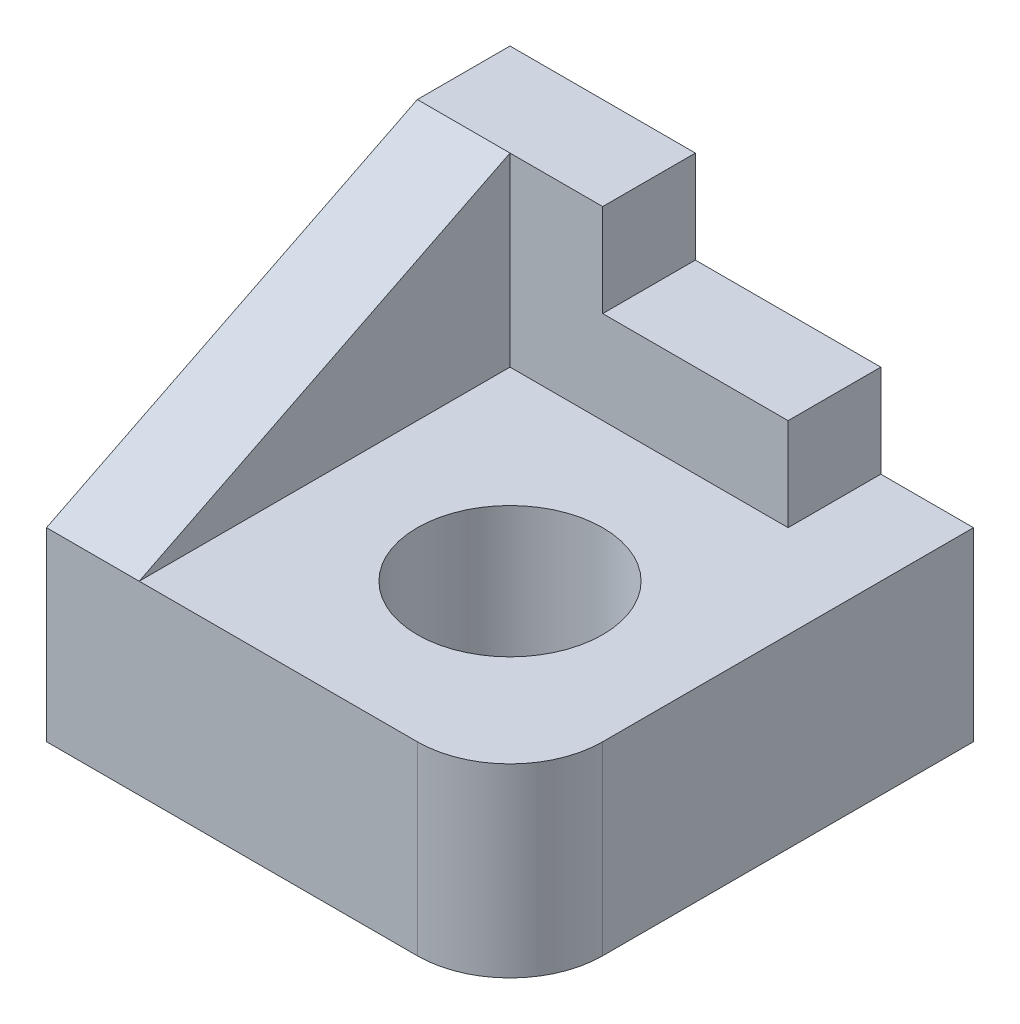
ISO-10303-21;
HEADER;
FILE_DESCRIPTION(('STEP AP214'),'2;1');
FILE_NAME('part.step','',(''),(''),'','','');
FILE_SCHEMA(('AUTOMOTIVE_DESIGN { 1 0 10303 214 1 1 1 1 }'));
ENDSEC;
DATA;
#1=APPLICATION_CONTEXT('core data for automotive mechanical design processes');
#2=APPLICATION_PROTOCOL_DEFINITION('international standard','automotive_design',2000,#1);
#3=PRODUCT_CONTEXT('',#1,'mechanical');
#4=PRODUCT('Part','Part','',(#3));
#5=PRODUCT_RELATED_PRODUCT_CATEGORY('part','',(#4));
#6=PRODUCT_DEFINITION_FORMATION('','',#4);
#7=PRODUCT_DEFINITION_CONTEXT('part definition',#1,'design');
#8=PRODUCT_DEFINITION('design','',#6,#7);
#9=PRODUCT_DEFINITION_SHAPE('','',#8);
#10=(LENGTH_UNIT() NAMED_UNIT(*) SI_UNIT(.MILLI.,.METRE.));
#11=(NAMED_UNIT(*) PLANE_ANGLE_UNIT() SI_UNIT($,.RADIAN.));
#12=(NAMED_UNIT(*) SI_UNIT($,.STERADIAN.) SOLID_ANGLE_UNIT());
#13=UNCERTAINTY_MEASURE_WITH_UNIT(LENGTH_MEASURE(1.E-05),#10,'distance_accuracy_value','');
#14=(GEOMETRIC_REPRESENTATION_CONTEXT(3) GLOBAL_UNCERTAINTY_ASSIGNED_CONTEXT((#13)) GLOBAL_UNIT_ASSIGNED_CONTEXT((#10,
#11,#12)) REPRESENTATION_CONTEXT('',''));
#15=CARTESIAN_POINT('',(0.,0.,0.));
#16=DIRECTION('',(0.,0.,1.));
#17=DIRECTION('',(1.,0.,0.));
#18=AXIS2_PLACEMENT_3D('',#15,#16,#17);
#19=CARTESIAN_POINT('',(0.,20.,0.));
#20=DIRECTION('',(1.,0.,0.));
#21=DIRECTION('',(0.,0.,-1.));
#22=AXIS2_PLACEMENT_3D('',#19,#20,#21);
#23=PLANE('',#22);
#24=DIRECTION('',(0.,-1.,0.));
#25=VECTOR('',#24,1.);
#26=CARTESIAN_POINT('',(0.,20.,50.));
#27=LINE('',#26,#25);
#28=CARTESIAN_POINT('',(0.,20.,50.));
#29=VERTEX_POINT('',#28);
#30=CARTESIAN_POINT('',(0.,0.,50.));
#31=VERTEX_POINT('',#30);
#32=EDGE_CURVE('E128',#29,#31,#27,.T.);
#33=ORIENTED_EDGE('',*,*,#32,.F.);
#34=DIRECTION('',(0.,-0.447213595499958,0.894427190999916));
#35=VECTOR('',#34,1.);
#36=CARTESIAN_POINT('',(0.,40.,10.));
#37=LINE('',#36,#35);
#38=CARTESIAN_POINT('',(0.,40.,10.));
#39=VERTEX_POINT('',#38);
#40=EDGE_CURVE('E113',#39,#29,#37,.T.);
#41=ORIENTED_EDGE('',*,*,#40,.F.);
#42=DIRECTION('',(0.,0.,-1.));
#43=VECTOR('',#42,1.);
#44=CARTESIAN_POINT('',(0.,40.,10.));
#45=LINE('',#44,#43);
#46=CARTESIAN_POINT('',(0.,40.,0.));
#47=VERTEX_POINT('',#46);
#48=EDGE_CURVE('E166',#39,#47,#45,.T.);
#49=ORIENTED_EDGE('',*,*,#48,.T.);
#50=DIRECTION('',(0.,-1.,0.));
#51=VECTOR('',#50,1.);
#52=CARTESIAN_POINT('',(0.,20.,0.));
#53=LINE('',#52,#51);
#54=CARTESIAN_POINT('',(0.,0.,0.));
#55=VERTEX_POINT('',#54);
#56=EDGE_CURVE('E142',#47,#55,#53,.T.);
#57=ORIENTED_EDGE('',*,*,#56,.T.);
#58=DIRECTION('',(0.,0.,1.));
#59=VECTOR('',#58,1.);
#60=CARTESIAN_POINT('',(0.,0.,0.));
#61=LINE('',#60,#59);
#62=EDGE_CURVE('E134',#55,#31,#61,.T.);
#63=ORIENTED_EDGE('',*,*,#62,.T.);
#64=EDGE_LOOP('',(#33,#41,#49,#57,#63));
#65=FACE_BOUND('',#64,.T.);
#66=ADVANCED_FACE('F30',(#65),#23,.F.);
#67=CARTESIAN_POINT('',(0.,20.,50.));
#68=DIRECTION('',(0.,0.,-1.));
#69=DIRECTION('',(-1.,0.,0.));
#70=AXIS2_PLACEMENT_3D('',#67,#68,#69);
#71=PLANE('',#70);
#72=DIRECTION('',(1.,0.,0.));
#73=VECTOR('',#72,1.);
#74=CARTESIAN_POINT('',(0.,20.,50.));
#75=LINE('',#74,#73);
#76=CARTESIAN_POINT('',(10.,20.,50.));
#77=VERTEX_POINT('',#76);
#78=CARTESIAN_POINT('',(40.,20.,50.));
#79=VERTEX_POINT('',#78);
#80=EDGE_CURVE('E45',#77,#79,#75,.T.);
#81=ORIENTED_EDGE('',*,*,#80,.F.);
#82=EDGE_CURVE('E117',#29,#77,#75,.T.);
#83=ORIENTED_EDGE('',*,*,#82,.F.);
#84=ORIENTED_EDGE('',*,*,#32,.T.);
#85=DIRECTION('',(1.,0.,0.));
#86=VECTOR('',#85,1.);
#87=CARTESIAN_POINT('',(0.,0.,50.));
#88=LINE('',#87,#86);
#89=CARTESIAN_POINT('',(40.,0.,50.));
#90=VERTEX_POINT('',#89);
#91=EDGE_CURVE('E52',#31,#90,#88,.T.);
#92=ORIENTED_EDGE('',*,*,#91,.T.);
#93=DIRECTION('',(0.,-1.,0.));
#94=VECTOR('',#93,1.);
#95=CARTESIAN_POINT('',(40.,20.,50.));
#96=LINE('',#95,#94);
#97=EDGE_CURVE('E147',#90,#79,#96,.F.);
#98=ORIENTED_EDGE('',*,*,#97,.T.);
#99=EDGE_LOOP('',(#81,#83,#84,#92,#98));
#100=FACE_BOUND('',#99,.T.);
#101=ADVANCED_FACE('F127',(#100),#71,.F.);
#102=CARTESIAN_POINT('',(50.,20.,0.));
#103=DIRECTION('',(-1.,0.,0.));
#104=DIRECTION('',(0.,0.,1.));
#105=AXIS2_PLACEMENT_3D('',#102,#103,#104);
#106=PLANE('',#105);
#107=DIRECTION('',(0.,0.,-1.));
#108=VECTOR('',#107,1.);
#109=CARTESIAN_POINT('',(50.,20.,0.));
#110=LINE('',#109,#108);
#111=CARTESIAN_POINT('',(50.,20.,40.));
#112=VERTEX_POINT('',#111);
#113=CARTESIAN_POINT('',(50.,20.,0.));
#114=VERTEX_POINT('',#113);
#115=EDGE_CURVE('E130',#112,#114,#110,.T.);
#116=ORIENTED_EDGE('',*,*,#115,.F.);
#117=DIRECTION('',(0.,-1.,0.));
#118=VECTOR('',#117,1.);
#119=CARTESIAN_POINT('',(50.,20.,40.));
#120=LINE('',#119,#118);
#121=CARTESIAN_POINT('',(50.,0.,40.));
#122=VERTEX_POINT('',#121);
#123=EDGE_CURVE('E135',#112,#122,#120,.T.);
#124=ORIENTED_EDGE('',*,*,#123,.T.);
#125=DIRECTION('',(0.,0.,-1.));
#126=VECTOR('',#125,1.);
#127=CARTESIAN_POINT('',(50.,0.,0.));
#128=LINE('',#127,#126);
#129=CARTESIAN_POINT('',(50.,0.,0.));
#130=VERTEX_POINT('',#129);
#131=EDGE_CURVE('E163',#122,#130,#128,.T.);
#132=ORIENTED_EDGE('',*,*,#131,.T.);
#133=DIRECTION('',(0.,-1.,0.));
#134=VECTOR('',#133,1.);
#135=CARTESIAN_POINT('',(50.,20.,0.));
#136=LINE('',#135,#134);
#137=EDGE_CURVE('E136',#114,#130,#136,.T.);
#138=ORIENTED_EDGE('',*,*,#137,.F.);
#139=EDGE_LOOP('',(#116,#124,#132,#138));
#140=FACE_BOUND('',#139,.T.);
#141=ADVANCED_FACE('F182',(#140),#106,.F.);
#142=CARTESIAN_POINT('',(0.,20.,0.));
#143=DIRECTION('',(0.,0.,1.));
#144=DIRECTION('',(1.,0.,0.));
#145=AXIS2_PLACEMENT_3D('',#142,#143,#144);
#146=PLANE('',#145);
#147=DIRECTION('',(-1.,0.,0.));
#148=VECTOR('',#147,1.);
#149=CARTESIAN_POINT('',(0.,0.,0.));
#150=LINE('',#149,#148);
#151=EDGE_CURVE('E165',#130,#55,#150,.T.);
#152=ORIENTED_EDGE('',*,*,#151,.T.);
#153=ORIENTED_EDGE('',*,*,#56,.F.);
#154=DIRECTION('',(1.,0.,0.));
#155=VECTOR('',#154,1.);
#156=CARTESIAN_POINT('',(0.,40.,0.));
#157=LINE('',#156,#155);
#158=CARTESIAN_POINT('',(20.,40.,0.));
#159=VERTEX_POINT('',#158);
#160=EDGE_CURVE('E210',#47,#159,#157,.T.);
#161=ORIENTED_EDGE('',*,*,#160,.T.);
#162=DIRECTION('',(0.,-1.,0.));
#163=VECTOR('',#162,1.);
#164=CARTESIAN_POINT('',(20.,40.,0.));
#165=LINE('',#164,#163);
#166=CARTESIAN_POINT('',(20.,30.,0.));
#167=VERTEX_POINT('',#166);
#168=EDGE_CURVE('E206',#159,#167,#165,.T.);
#169=ORIENTED_EDGE('',*,*,#168,.T.);
#170=DIRECTION('',(1.,0.,0.));
#171=VECTOR('',#170,1.);
#172=CARTESIAN_POINT('',(20.,30.,0.));
#173=LINE('',#172,#171);
#174=CARTESIAN_POINT('',(40.,30.,0.));
#175=VERTEX_POINT('',#174);
#176=EDGE_CURVE('E203',#167,#175,#173,.T.);
#177=ORIENTED_EDGE('',*,*,#176,.T.);
#178=DIRECTION('',(0.,-1.,0.));
#179=VECTOR('',#178,1.);
#180=CARTESIAN_POINT('',(40.,30.,0.));
#181=LINE('',#180,#179);
#182=CARTESIAN_POINT('',(40.,20.,0.));
#183=VERTEX_POINT('',#182);
#184=EDGE_CURVE('E188',#175,#183,#181,.T.);
#185=ORIENTED_EDGE('',*,*,#184,.T.);
#186=DIRECTION('',(-1.,0.,0.));
#187=VECTOR('',#186,1.);
#188=CARTESIAN_POINT('',(0.,20.,0.));
#189=LINE('',#188,#187);
#190=EDGE_CURVE('E150',#114,#183,#189,.T.);
#191=ORIENTED_EDGE('',*,*,#190,.F.);
#192=ORIENTED_EDGE('',*,*,#137,.T.);
#193=EDGE_LOOP('',(#152,#153,#161,#169,#177,#185,#191,#192));
#194=FACE_BOUND('',#193,.T.);
#195=ADVANCED_FACE('F185',(#194),#146,.F.);
#196=CARTESIAN_POINT('',(0.,20.,50.));
#197=DIRECTION('',(0.,1.,0.));
#198=DIRECTION('',(0.,0.,1.));
#199=AXIS2_PLACEMENT_3D('',#196,#197,#198);
#200=PLANE('',#199);
#201=DIRECTION('',(0.,0.,-1.));
#202=VECTOR('',#201,1.);
#203=CARTESIAN_POINT('',(10.,20.,50.));
#204=LINE('',#203,#202);
#205=CARTESIAN_POINT('',(10.,20.,10.));
#206=VERTEX_POINT('',#205);
#207=EDGE_CURVE('E331',#77,#206,#204,.T.);
#208=ORIENTED_EDGE('',*,*,#207,.F.);
#209=ORIENTED_EDGE('',*,*,#80,.T.);
#210=CARTESIAN_POINT('',(40.,20.,40.));
#211=DIRECTION('',(0.,1.,0.));
#212=DIRECTION('',(0.,0.,1.));
#213=AXIS2_PLACEMENT_3D('',#210,#211,#212);
#214=CIRCLE('',#213,10.);
#215=EDGE_CURVE('E38',#79,#112,#214,.T.);
#216=ORIENTED_EDGE('',*,*,#215,.T.);
#217=ORIENTED_EDGE('',*,*,#115,.T.);
#218=ORIENTED_EDGE('',*,*,#190,.T.);
#219=DIRECTION('',(0.,0.,-1.));
#220=VECTOR('',#219,1.);
#221=CARTESIAN_POINT('',(40.,20.,10.));
#222=LINE('',#221,#220);
#223=CARTESIAN_POINT('',(40.,20.,10.));
#224=VERTEX_POINT('',#223);
#225=EDGE_CURVE('E191',#224,#183,#222,.T.);
#226=ORIENTED_EDGE('',*,*,#225,.F.);
#227=DIRECTION('',(-1.,0.,0.));
#228=VECTOR('',#227,1.);
#229=CARTESIAN_POINT('',(40.,20.,10.));
#230=LINE('',#229,#228);
#231=EDGE_CURVE('E154',#224,#206,#230,.T.);
#232=ORIENTED_EDGE('',*,*,#231,.T.);
#233=EDGE_LOOP('',(#208,#209,#216,#217,#218,#226,#232));
#234=FACE_BOUND('',#233,.T.);
#235=CARTESIAN_POINT('',(30.,20.,30.));
#236=DIRECTION('',(0.,1.,0.));
#237=DIRECTION('',(0.,0.,1.));
#238=AXIS2_PLACEMENT_3D('',#235,#236,#237);
#239=CIRCLE('',#238,10.);
#240=CARTESIAN_POINT('',(30.,20.,40.));
#241=VERTEX_POINT('',#240);
#242=EDGE_CURVE('E194',#241,#241,#239,.T.);
#243=ORIENTED_EDGE('',*,*,#242,.F.);
#244=EDGE_LOOP('',(#243));
#245=FACE_BOUND('',#244,.T.);
#246=ADVANCED_FACE('F178',(#234,#245),#200,.T.);
#247=CARTESIAN_POINT('',(0.,0.,50.));
#248=DIRECTION('',(0.,1.,0.));
#249=DIRECTION('',(0.,0.,1.));
#250=AXIS2_PLACEMENT_3D('',#247,#248,#249);
#251=PLANE('',#250);
#252=CARTESIAN_POINT('',(30.,0.,30.));
#253=DIRECTION('',(0.,1.,0.));
#254=DIRECTION('',(0.,0.,1.));
#255=AXIS2_PLACEMENT_3D('',#252,#253,#254);
#256=CIRCLE('',#255,10.);
#257=CARTESIAN_POINT('',(30.,0.,40.));
#258=VERTEX_POINT('',#257);
#259=EDGE_CURVE('E161',#258,#258,#256,.T.);
#260=ORIENTED_EDGE('',*,*,#259,.T.);
#261=EDGE_LOOP('',(#260));
#262=FACE_BOUND('',#261,.T.);
#263=CARTESIAN_POINT('',(40.,0.,40.));
#264=DIRECTION('',(0.,1.,0.));
#265=DIRECTION('',(0.,0.,1.));
#266=AXIS2_PLACEMENT_3D('',#263,#264,#265);
#267=CIRCLE('',#266,10.);
#268=EDGE_CURVE('E139',#122,#90,#267,.F.);
#269=ORIENTED_EDGE('',*,*,#268,.T.);
#270=ORIENTED_EDGE('',*,*,#91,.F.);
#271=ORIENTED_EDGE('',*,*,#62,.F.);
#272=ORIENTED_EDGE('',*,*,#151,.F.);
#273=ORIENTED_EDGE('',*,*,#131,.F.);
#274=EDGE_LOOP('',(#269,#270,#271,#272,#273));
#275=FACE_BOUND('',#274,.T.);
#276=ADVANCED_FACE('F171',(#262,#275),#251,.F.);
#277=CARTESIAN_POINT('',(40.,20.,40.));
#278=DIRECTION('',(0.,-1.,0.));
#279=DIRECTION('',(0.,0.,-1.));
#280=AXIS2_PLACEMENT_3D('',#277,#278,#279);
#281=CYLINDRICAL_SURFACE('',#280,10.);
#282=ORIENTED_EDGE('',*,*,#215,.F.);
#283=ORIENTED_EDGE('',*,*,#97,.F.);
#284=ORIENTED_EDGE('',*,*,#268,.F.);
#285=ORIENTED_EDGE('',*,*,#123,.F.);
#286=EDGE_LOOP('',(#282,#283,#284,#285));
#287=FACE_BOUND('',#286,.T.);
#288=ADVANCED_FACE('F32',(#287),#281,.T.);
#289=CARTESIAN_POINT('',(30.,0.,30.));
#290=DIRECTION('',(0.,1.,0.));
#291=DIRECTION('',(0.,0.,1.));
#292=AXIS2_PLACEMENT_3D('',#289,#290,#291);
#293=CYLINDRICAL_SURFACE('',#292,10.);
#294=ORIENTED_EDGE('',*,*,#259,.F.);
#295=EDGE_LOOP('',(#294));
#296=FACE_BOUND('',#295,.T.);
#297=ORIENTED_EDGE('',*,*,#242,.T.);
#298=EDGE_LOOP('',(#297));
#299=FACE_BOUND('',#298,.T.);
#300=ADVANCED_FACE('F224',(#296,#299),#293,.F.);
#301=CARTESIAN_POINT('',(40.,30.,10.));
#302=DIRECTION('',(1.,0.,0.));
#303=DIRECTION('',(0.,0.,-1.));
#304=AXIS2_PLACEMENT_3D('',#301,#302,#303);
#305=PLANE('',#304);
#306=ORIENTED_EDGE('',*,*,#184,.F.);
#307=DIRECTION('',(0.,0.,-1.));
#308=VECTOR('',#307,1.);
#309=CARTESIAN_POINT('',(40.,30.,10.));
#310=LINE('',#309,#308);
#311=CARTESIAN_POINT('',(40.,30.,10.));
#312=VERTEX_POINT('',#311);
#313=EDGE_CURVE('E195',#312,#175,#310,.T.);
#314=ORIENTED_EDGE('',*,*,#313,.F.);
#315=DIRECTION('',(0.,-1.,0.));
#316=VECTOR('',#315,1.);
#317=CARTESIAN_POINT('',(40.,30.,10.));
#318=LINE('',#317,#316);
#319=EDGE_CURVE('E219',#312,#224,#318,.T.);
#320=ORIENTED_EDGE('',*,*,#319,.T.);
#321=ORIENTED_EDGE('',*,*,#225,.T.);
#322=EDGE_LOOP('',(#306,#314,#320,#321));
#323=FACE_BOUND('',#322,.T.);
#324=ADVANCED_FACE('F227',(#323),#305,.T.);
#325=CARTESIAN_POINT('',(20.,30.,10.));
#326=DIRECTION('',(0.,1.,0.));
#327=DIRECTION('',(-1.,0.,0.));
#328=AXIS2_PLACEMENT_3D('',#325,#326,#327);
#329=PLANE('',#328);
#330=ORIENTED_EDGE('',*,*,#176,.F.);
#331=DIRECTION('',(0.,0.,-1.));
#332=VECTOR('',#331,1.);
#333=CARTESIAN_POINT('',(20.,30.,10.));
#334=LINE('',#333,#332);
#335=CARTESIAN_POINT('',(20.,30.,10.));
#336=VERTEX_POINT('',#335);
#337=EDGE_CURVE('E198',#336,#167,#334,.T.);
#338=ORIENTED_EDGE('',*,*,#337,.F.);
#339=DIRECTION('',(1.,0.,0.));
#340=VECTOR('',#339,1.);
#341=CARTESIAN_POINT('',(20.,30.,10.));
#342=LINE('',#341,#340);
#343=EDGE_CURVE('E339',#336,#312,#342,.T.);
#344=ORIENTED_EDGE('',*,*,#343,.T.);
#345=ORIENTED_EDGE('',*,*,#313,.T.);
#346=EDGE_LOOP('',(#330,#338,#344,#345));
#347=FACE_BOUND('',#346,.T.);
#348=ADVANCED_FACE('F320',(#347),#329,.T.);
#349=CARTESIAN_POINT('',(20.,40.,10.));
#350=DIRECTION('',(1.,0.,0.));
#351=DIRECTION('',(0.,0.,-1.));
#352=AXIS2_PLACEMENT_3D('',#349,#350,#351);
#353=PLANE('',#352);
#354=ORIENTED_EDGE('',*,*,#168,.F.);
#355=DIRECTION('',(0.,0.,-1.));
#356=VECTOR('',#355,1.);
#357=CARTESIAN_POINT('',(20.,40.,10.));
#358=LINE('',#357,#356);
#359=CARTESIAN_POINT('',(20.,40.,10.));
#360=VERTEX_POINT('',#359);
#361=EDGE_CURVE('E215',#360,#159,#358,.T.);
#362=ORIENTED_EDGE('',*,*,#361,.F.);
#363=DIRECTION('',(0.,-1.,0.));
#364=VECTOR('',#363,1.);
#365=CARTESIAN_POINT('',(20.,40.,10.));
#366=LINE('',#365,#364);
#367=EDGE_CURVE('E334',#360,#336,#366,.T.);
#368=ORIENTED_EDGE('',*,*,#367,.T.);
#369=ORIENTED_EDGE('',*,*,#337,.T.);
#370=EDGE_LOOP('',(#354,#362,#368,#369));
#371=FACE_BOUND('',#370,.T.);
#372=ADVANCED_FACE('F282',(#371),#353,.T.);
#373=CARTESIAN_POINT('',(0.,40.,10.));
#374=DIRECTION('',(0.,1.,0.));
#375=DIRECTION('',(0.,0.,1.));
#376=AXIS2_PLACEMENT_3D('',#373,#374,#375);
#377=PLANE('',#376);
#378=ORIENTED_EDGE('',*,*,#361,.T.);
#379=ORIENTED_EDGE('',*,*,#160,.F.);
#380=ORIENTED_EDGE('',*,*,#48,.F.);
#381=DIRECTION('',(1.,0.,0.));
#382=VECTOR('',#381,1.);
#383=CARTESIAN_POINT('',(0.,40.,10.));
#384=LINE('',#383,#382);
#385=CARTESIAN_POINT('',(10.,40.,10.));
#386=VERTEX_POINT('',#385);
#387=EDGE_CURVE('E120',#39,#386,#384,.T.);
#388=ORIENTED_EDGE('',*,*,#387,.T.);
#389=EDGE_CURVE('E205',#386,#360,#384,.T.);
#390=ORIENTED_EDGE('',*,*,#389,.T.);
#391=EDGE_LOOP('',(#378,#379,#380,#388,#390));
#392=FACE_BOUND('',#391,.T.);
#393=ADVANCED_FACE('F276',(#392),#377,.T.);
#394=CARTESIAN_POINT('',(0.,20.,10.));
#395=DIRECTION('',(0.,0.,-1.));
#396=DIRECTION('',(-1.,0.,0.));
#397=AXIS2_PLACEMENT_3D('',#394,#395,#396);
#398=PLANE('',#397);
#399=ORIENTED_EDGE('',*,*,#389,.F.);
#400=DIRECTION('',(0.,-1.,0.));
#401=VECTOR('',#400,1.);
#402=CARTESIAN_POINT('',(10.,20.,10.));
#403=LINE('',#402,#401);
#404=EDGE_CURVE('E11',#386,#206,#403,.T.);
#405=ORIENTED_EDGE('',*,*,#404,.T.);
#406=ORIENTED_EDGE('',*,*,#231,.F.);
#407=ORIENTED_EDGE('',*,*,#319,.F.);
#408=ORIENTED_EDGE('',*,*,#343,.F.);
#409=ORIENTED_EDGE('',*,*,#367,.F.);
#410=EDGE_LOOP('',(#399,#405,#406,#407,#408,#409));
#411=FACE_BOUND('',#410,.T.);
#412=ADVANCED_FACE('F281',(#411),#398,.F.);
#413=CARTESIAN_POINT('',(0.,40.,10.));
#414=DIRECTION('',(0.,0.894427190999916,0.447213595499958));
#415=DIRECTION('',(0.,-0.447213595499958,0.894427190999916));
#416=AXIS2_PLACEMENT_3D('',#413,#414,#415);
#417=PLANE('',#416);
#418=ORIENTED_EDGE('',*,*,#40,.T.);
#419=ORIENTED_EDGE('',*,*,#82,.T.);
#420=DIRECTION('',(0.,-0.447213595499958,0.894427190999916));
#421=VECTOR('',#420,1.);
#422=CARTESIAN_POINT('',(10.,40.,10.));
#423=LINE('',#422,#421);
#424=EDGE_CURVE('E125',#386,#77,#423,.T.);
#425=ORIENTED_EDGE('',*,*,#424,.F.);
#426=ORIENTED_EDGE('',*,*,#387,.F.);
#427=EDGE_LOOP('',(#418,#419,#425,#426));
#428=FACE_BOUND('',#427,.T.);
#429=ADVANCED_FACE('F115',(#428),#417,.T.);
#430=CARTESIAN_POINT('',(10.,20.0000125,24.9999875));
#431=DIRECTION('',(1.,0.,0.));
#432=DIRECTION('',(0.,0.,-1.));
#433=AXIS2_PLACEMENT_3D('',#430,#431,#432);
#434=PLANE('',#433);
#435=ORIENTED_EDGE('',*,*,#424,.T.);
#436=ORIENTED_EDGE('',*,*,#207,.T.);
#437=ORIENTED_EDGE('',*,*,#404,.F.);
#438=EDGE_LOOP('',(#435,#436,#437));
#439=FACE_BOUND('',#438,.T.);
#440=ADVANCED_FACE('F304',(#439),#434,.T.);
#441=CLOSED_SHELL('',(#66,#101,#141,#195,#246,#276,#288,#300,#324,#348,#372,#393,#412,#429,#440));
#442=MANIFOLD_SOLID_BREP('B2',#441);
#443=ADVANCED_BREP_SHAPE_REPRESENTATION('',(#18,#442),#14);
#444=SHAPE_DEFINITION_REPRESENTATION(#9,#443);
ENDSEC;
END-ISO-10303-21;
